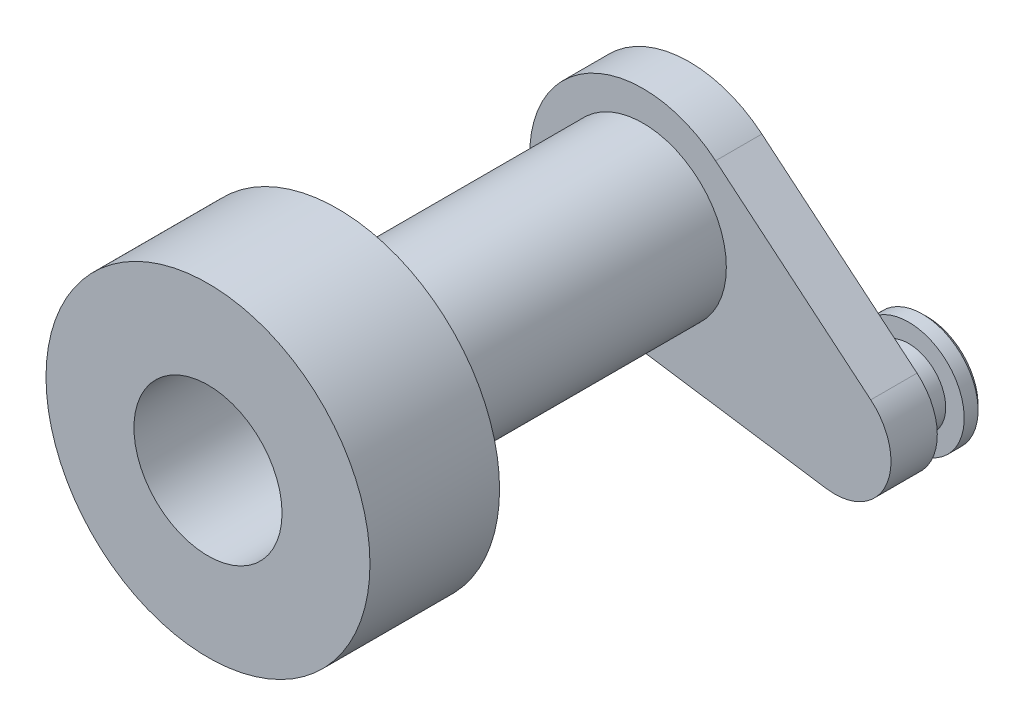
from build123d import *

# Parameters (mm, degrees)
ESQUISSE2_R             = 17.5
BASE_EXTRUSION_DEPTH    = 14
ESQUISSE3_R             = 9
BOSS_EXTRU_1_DEPTH      = 38
ESQUISSE4_R             = 8
ENL_V_MAT_EXTRU_1_DEPTH = 408.309452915
ESQUISSE5_R             = 7.626974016
BOSS_EXTRU_2_DEPTH      = 5
ESQUISSE6_R             = 4
BOSS_EXTRU_4_DEPTH      = 3
ESQUISSE7_R             = 6
BOSS_EXTRU_5_DEPTH      = 2
CHANFREIN1_SIZE         = 0.5


with BuildPart() as part:
    # Esquisse2 → Base-Extrusion (new body)
    with BuildSketch(Plane.XY):
        with Locations((353.595340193, 142.140968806)):
            Circle(ESQUISSE2_R)
    extrude(amount=-BASE_EXTRUSION_DEPTH)

    # Esquisse3 → Boss.-Extru.1 (add)
    with BuildSketch(Plane(origin=(0, 0, -14), x_dir=(-1, 0, 0), z_dir=(0, 0, -1))):
        with Locations(Location((-353.595340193, 142.140968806, 0), (0, 0, 180))):
            Circle(ESQUISSE3_R)
    extrude(amount=BOSS_EXTRU_1_DEPTH)

    # Esquisse4 → Enl_v. mat.-Extru.1 (cut, through all)
    with BuildSketch(Plane.XY):
        with Locations((353.595340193, 142.140968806)):
            Circle(ESQUISSE4_R)
    extrude(amount=-ENL_V_MAT_EXTRU_1_DEPTH, mode=Mode.SUBTRACT)

    # Esquisse5 → Boss.-Extru.2 (add)
    with BuildSketch(Plane(origin=(839.909771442, -92.077010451, -52), x_dir=(-1, 0, 0), z_dir=(0, 0, -1))):
        with BuildLine():
            Line((461.713017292, 229.62432236), (478.475212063, 243.612084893))
            ThreePointArc((478.475212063, 243.612084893), (497.481002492, 239.219005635), (488.103214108, 222.114143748))
            Line((488.103214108, 222.114143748), (466.505964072, 218.922362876))
            ThreePointArc((466.505964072, 218.922362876), (460.056617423, 222.45823522), (461.713017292, 229.62432236))
        make_face()
        with Locations((486.314431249, 234.217979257)):
            Circle(ESQUISSE5_R, mode=Mode.SUBTRACT)
    extrude(amount=-BOSS_EXTRU_2_DEPTH)

    # Esquisse6 → Boss.-Extru.4 (add)
    with BuildSketch(Plane(origin=(0, 0, -52), x_dir=(-1, 0, 0), z_dir=(0, 0, -1))):
        with Locations((-374.29428714, 132.870801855)):
            Circle(ESQUISSE6_R)
    extrude(amount=BOSS_EXTRU_4_DEPTH)

    # Esquisse7 → Boss.-Extru.5 (add)
    with BuildSketch(Plane(origin=(0, 0, -55), x_dir=(-1, 0, 0), z_dir=(0, 0, -1))):
        with Locations((-374.29428714, 132.870801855)):
            Circle(ESQUISSE7_R)
    extrude(amount=BOSS_EXTRU_5_DEPTH)

    # Chanfrein1
    chanfrein1_edges = [part.edges().sort_by_distance(p)[0] for p in [
        (380.29428714, 132.870801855, -57),
    ]]
    chamfer(chanfrein1_edges, length=CHANFREIN1_SIZE)


solid = part.part
